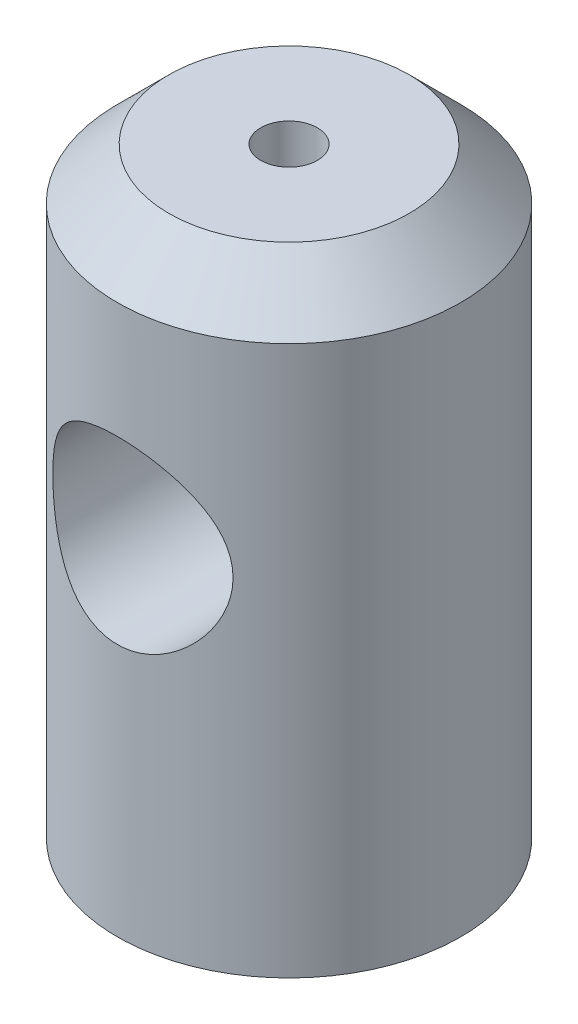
ISO-10303-21;
HEADER;
FILE_DESCRIPTION(('STEP AP214'),'2;1');
FILE_NAME('part.step','',(''),(''),'','','');
FILE_SCHEMA(('AUTOMOTIVE_DESIGN { 1 0 10303 214 1 1 1 1 }'));
ENDSEC;
DATA;
#1=APPLICATION_CONTEXT('core data for automotive mechanical design processes');
#2=APPLICATION_PROTOCOL_DEFINITION('international standard','automotive_design',2000,#1);
#3=PRODUCT_CONTEXT('',#1,'mechanical');
#4=PRODUCT('Part','Part','',(#3));
#5=PRODUCT_RELATED_PRODUCT_CATEGORY('part','',(#4));
#6=PRODUCT_DEFINITION_FORMATION('','',#4);
#7=PRODUCT_DEFINITION_CONTEXT('part definition',#1,'design');
#8=PRODUCT_DEFINITION('design','',#6,#7);
#9=PRODUCT_DEFINITION_SHAPE('','',#8);
#10=(LENGTH_UNIT() NAMED_UNIT(*) SI_UNIT(.MILLI.,.METRE.));
#11=(NAMED_UNIT(*) PLANE_ANGLE_UNIT() SI_UNIT($,.RADIAN.));
#12=(NAMED_UNIT(*) SI_UNIT($,.STERADIAN.) SOLID_ANGLE_UNIT());
#13=UNCERTAINTY_MEASURE_WITH_UNIT(LENGTH_MEASURE(1.E-05),#10,'distance_accuracy_value','');
#14=(GEOMETRIC_REPRESENTATION_CONTEXT(3) GLOBAL_UNCERTAINTY_ASSIGNED_CONTEXT((#13)) GLOBAL_UNIT_ASSIGNED_CONTEXT((#10,
#11,#12)) REPRESENTATION_CONTEXT('',''));
#15=CARTESIAN_POINT('',(0.,0.,0.));
#16=DIRECTION('',(0.,0.,1.));
#17=DIRECTION('',(1.,0.,0.));
#18=AXIS2_PLACEMENT_3D('',#15,#16,#17);
#19=CARTESIAN_POINT('',(0.,35.,0.));
#20=DIRECTION('',(0.,1.,0.));
#21=DIRECTION('',(0.,0.,1.));
#22=AXIS2_PLACEMENT_3D('',#19,#20,#21);
#23=CYLINDRICAL_SURFACE('',#22,1.64999999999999);
#24=CARTESIAN_POINT('',(0.,14.75,1.64999999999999));
#25=CARTESIAN_POINT('',(0.0903138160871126,14.7500003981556,1.64999948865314));
#26=CARTESIAN_POINT('',(0.180633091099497,14.7523524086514,1.64256051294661));
#27=CARTESIAN_POINT('',(0.358628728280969,14.7615045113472,1.61308023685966));
#28=CARTESIAN_POINT('',(0.44630451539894,14.76830556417,1.59103578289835));
#29=CARTESIAN_POINT('',(0.616420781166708,14.7856131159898,1.5331625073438));
#30=CARTESIAN_POINT('',(0.698869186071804,14.7961138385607,1.49735516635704));
#31=CARTESIAN_POINT('',(0.85659145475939,14.819737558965,1.41306442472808));
#32=CARTESIAN_POINT('',(0.931864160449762,14.832860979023,1.36457898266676));
#33=CARTESIAN_POINT('',(1.0754471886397,14.8607960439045,1.25471623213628));
#34=CARTESIAN_POINT('',(1.14350224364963,14.8756447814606,1.19301477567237));
#35=CARTESIAN_POINT('',(1.26848899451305,14.9051430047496,1.05916156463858));
#36=CARTESIAN_POINT('',(1.3254185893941,14.9197924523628,0.987007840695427));
#37=CARTESIAN_POINT('',(1.42792858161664,14.9476322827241,0.83208107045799));
#38=CARTESIAN_POINT('',(1.47318901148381,14.9607769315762,0.749087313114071));
#39=CARTESIAN_POINT('',(1.549003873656,14.9835604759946,0.576186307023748));
#40=CARTESIAN_POINT('',(1.57956223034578,14.9932003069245,0.486280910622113));
#41=CARTESIAN_POINT('',(1.62416947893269,15.0074945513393,0.304991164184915));
#42=CARTESIAN_POINT('',(1.63869230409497,15.0122916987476,0.213734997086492));
#43=CARTESIAN_POINT('',(1.65229695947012,15.0167810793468,0.0299649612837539));
#44=CARTESIAN_POINT('',(1.6513829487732,15.0164746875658,-0.062548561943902));
#45=CARTESIAN_POINT('',(1.63451033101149,15.0109175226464,-0.242276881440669));
#46=CARTESIAN_POINT('',(1.61915550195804,15.0058651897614,-0.32955553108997));
#47=CARTESIAN_POINT('',(1.57481655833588,14.991707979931,-0.500229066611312));
#48=CARTESIAN_POINT('',(1.54583098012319,14.98260266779,-0.583623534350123));
#49=CARTESIAN_POINT('',(1.47462957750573,14.9612142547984,-0.745594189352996));
#50=CARTESIAN_POINT('',(1.43222506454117,14.9488862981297,-0.824081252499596));
#51=CARTESIAN_POINT('',(1.33552053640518,14.9224620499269,-0.973023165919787));
#52=CARTESIAN_POINT('',(1.28121740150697,14.9083652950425,-1.04347590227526));
#53=CARTESIAN_POINT('',(1.15929958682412,14.879196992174,-1.17776098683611));
#54=CARTESIAN_POINT('',(1.09118686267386,14.8641104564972,-1.24113874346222));
#55=CARTESIAN_POINT('',(0.945112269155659,14.8352349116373,-1.3556835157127));
#56=CARTESIAN_POINT('',(0.867149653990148,14.8214460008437,-1.40684960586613));
#57=CARTESIAN_POINT('',(0.70270494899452,14.796571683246,-1.49583139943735));
#58=CARTESIAN_POINT('',(0.616159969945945,14.7855086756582,-1.53353756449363));
#59=CARTESIAN_POINT('',(0.437526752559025,14.7674944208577,-1.59372070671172));
#60=CARTESIAN_POINT('',(0.345440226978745,14.7605419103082,-1.6162023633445));
#61=CARTESIAN_POINT('',(0.162195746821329,14.7517357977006,-1.64452136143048));
#62=CARTESIAN_POINT('',(0.0711417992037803,14.7496937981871,-1.65097401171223));
#63=CARTESIAN_POINT('',(-0.110758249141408,14.7503809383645,-1.64878818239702));
#64=CARTESIAN_POINT('',(-0.201604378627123,14.7531093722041,-1.64015193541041));
#65=CARTESIAN_POINT('',(-0.378129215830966,14.7629069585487,-1.60852687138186));
#66=CARTESIAN_POINT('',(-0.463880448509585,14.7698650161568,-1.58590514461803));
#67=CARTESIAN_POINT('',(-0.630345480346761,14.7873063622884,-1.52740011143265));
#68=CARTESIAN_POINT('',(-0.711058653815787,14.7977900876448,-1.49151516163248));
#69=CARTESIAN_POINT('',(-0.86736096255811,14.8215261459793,-1.40651800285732));
#70=CARTESIAN_POINT('',(-0.942775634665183,14.8348401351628,-1.35710266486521));
#71=CARTESIAN_POINT('',(-1.08444816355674,14.8627153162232,-1.24681048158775));
#72=CARTESIAN_POINT('',(-1.15070350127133,14.8772768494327,-1.18593049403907));
#73=CARTESIAN_POINT('',(-1.27493568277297,14.9067414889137,-1.05154292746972));
#74=CARTESIAN_POINT('',(-1.33247390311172,14.9216348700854,-0.977626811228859));
#75=CARTESIAN_POINT('',(-1.43437044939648,14.9494672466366,-0.820864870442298));
#76=CARTESIAN_POINT('',(-1.47872896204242,14.9624062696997,-0.738019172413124));
#77=CARTESIAN_POINT('',(-1.55273603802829,14.9847225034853,-0.565905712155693));
#78=CARTESIAN_POINT('',(-1.58243963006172,14.9941130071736,-0.476663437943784));
#79=CARTESIAN_POINT('',(-1.62628952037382,15.0081843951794,-0.294087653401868));
#80=CARTESIAN_POINT('',(-1.64044182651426,15.0128670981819,-0.200755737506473));
#81=CARTESIAN_POINT('',(-1.65235277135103,15.0168017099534,-0.0172396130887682));
#82=CARTESIAN_POINT('',(-1.65083165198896,15.0162922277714,0.072893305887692));
#83=CARTESIAN_POINT('',(-1.6331804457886,15.0104803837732,0.251551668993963));
#84=CARTESIAN_POINT('',(-1.61705105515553,15.0051782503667,0.340077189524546));
#85=CARTESIAN_POINT('',(-1.57112569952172,14.9905461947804,0.511703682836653));
#86=CARTESIAN_POINT('',(-1.54153808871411,14.9812778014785,0.594866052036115));
#87=CARTESIAN_POINT('',(-1.46970059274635,14.9597738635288,0.755112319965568));
#88=CARTESIAN_POINT('',(-1.42744811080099,14.9475377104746,0.832194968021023));
#89=CARTESIAN_POINT('',(-1.32952828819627,14.9208738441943,0.981390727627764));
#90=CARTESIAN_POINT('',(-1.27339690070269,14.9063786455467,1.05318718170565));
#91=CARTESIAN_POINT('',(-1.15012648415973,14.8771378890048,1.18657494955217));
#92=CARTESIAN_POINT('',(-1.08298449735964,14.8623922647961,1.24816351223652));
#93=CARTESIAN_POINT('',(-0.936920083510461,14.8337254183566,1.36143308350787));
#94=CARTESIAN_POINT('',(-0.857680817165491,14.8198477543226,1.41271778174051));
#95=CARTESIAN_POINT('',(-0.691270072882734,14.7950306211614,1.50117156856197));
#96=CARTESIAN_POINT('',(-0.604101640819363,14.7840900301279,1.53834604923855));
#97=CARTESIAN_POINT('',(-0.431618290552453,14.7671139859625,1.59491788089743));
#98=CARTESIAN_POINT('',(-0.346727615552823,14.7607523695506,1.61551363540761));
#99=CARTESIAN_POINT('',(-0.17455932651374,14.7521956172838,1.64305352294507));
#100=CARTESIAN_POINT('',(-0.087282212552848,14.7499996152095,1.65000049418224));
#101=CARTESIAN_POINT('',(0.,14.75,1.64999999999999));
#102=B_SPLINE_CURVE_WITH_KNOTS('',3,(#24,#25,#26,#27,#28,#29,#30,#31,#32,#33,#34,#35,#36,#37,
#38,#39,#40,#41,#42,#43,#44,#45,#46,#47,#48,#49,#50,#51,#52,#53,#54,#55,#56,#57,#58,#59,#60,#61,
#62,#63,#64,#65,#66,#67,#68,#69,#70,#71,#72,#73,#74,#75,#76,#77,#78,#79,#80,#81,#82,#83,#84,#85,
#86,#87,#88,#89,#90,#91,#92,#93,#94,#95,#96,#97,#98,#99,#100,#101),.UNSPECIFIED.,.T.,.F.,(4,2,2,
2,2,2,2,2,2,2,2,2,2,2,2,2,2,2,2,2,2,2,2,2,2,2,2,2,2,2,2,2,2,2,2,2,2,2,4),(0.,0.270620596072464,
0.541299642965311,0.811557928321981,1.08185975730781,1.35976161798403,1.63771590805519,
1.92263190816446,2.20747181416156,2.4836470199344,2.75974781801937,3.02479487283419,
3.28987039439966,3.55885253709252,3.82790528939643,4.10935449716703,4.3908250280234,
4.67453660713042,4.958160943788,5.23071678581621,5.50323230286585,5.76888188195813,
6.03456438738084,6.30677004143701,6.57905041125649,6.86225155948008,7.14544869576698,
7.42757418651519,7.70959064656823,7.97870759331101,8.24781171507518,8.51288447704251,
8.77801162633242,9.05361351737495,9.32928956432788,9.61410809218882,9.89881766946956,
10.1604086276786,10.4219451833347),.UNSPECIFIED.);
#103=CARTESIAN_POINT('',(0.,14.75,1.64999999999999));
#104=VERTEX_POINT('',#103);
#105=EDGE_CURVE('E36',#104,#104,#102,.T.);
#106=ORIENTED_EDGE('',*,*,#105,.T.);
#107=EDGE_LOOP('',(#106));
#108=FACE_BOUND('',#107,.T.);
#109=CARTESIAN_POINT('',(0.,0.,0.));
#110=DIRECTION('',(0.,1.,0.));
#111=DIRECTION('',(0.,0.,1.));
#112=AXIS2_PLACEMENT_3D('',#109,#110,#111);
#113=CIRCLE('',#112,1.64999999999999);
#114=CARTESIAN_POINT('',(0.,0.,1.64999999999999));
#115=VERTEX_POINT('',#114);
#116=EDGE_CURVE('E107',#115,#115,#113,.T.);
#117=ORIENTED_EDGE('',*,*,#116,.F.);
#118=EDGE_LOOP('',(#117));
#119=FACE_BOUND('',#118,.T.);
#120=ADVANCED_FACE('F32',(#108,#119),#23,.F.);
#121=CARTESIAN_POINT('',(0.,35.,0.));
#122=DIRECTION('',(0.,1.,0.));
#123=DIRECTION('',(0.,0.,1.));
#124=AXIS2_PLACEMENT_3D('',#121,#122,#123);
#125=PLANE('',#124);
#126=CARTESIAN_POINT('',(0.,35.,0.));
#127=DIRECTION('',(0.,1.,0.));
#128=DIRECTION('',(0.,0.,1.));
#129=AXIS2_PLACEMENT_3D('',#126,#127,#128);
#130=CIRCLE('',#129,1.64999999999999);
#131=CARTESIAN_POINT('',(0.,35.,1.64999999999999));
#132=VERTEX_POINT('',#131);
#133=EDGE_CURVE('E106',#132,#132,#130,.T.);
#134=ORIENTED_EDGE('',*,*,#133,.F.);
#135=EDGE_LOOP('',(#134));
#136=FACE_BOUND('',#135,.T.);
#137=CARTESIAN_POINT('',(0.,35.,0.));
#138=DIRECTION('',(0.,-1.,0.));
#139=DIRECTION('',(0.,0.,-1.));
#140=AXIS2_PLACEMENT_3D('',#137,#138,#139);
#141=CIRCLE('',#140,7.);
#142=CARTESIAN_POINT('',(0.,35.,-7.));
#143=VERTEX_POINT('',#142);
#144=EDGE_CURVE('E10',#143,#143,#141,.T.);
#145=ORIENTED_EDGE('',*,*,#144,.F.);
#146=EDGE_LOOP('',(#145));
#147=FACE_BOUND('',#146,.T.);
#148=ADVANCED_FACE('F34',(#136,#147),#125,.T.);
#149=CARTESIAN_POINT('',(0.,32.,0.));
#150=DIRECTION('',(0.,-1.,0.));
#151=DIRECTION('',(0.,0.,-1.));
#152=AXIS2_PLACEMENT_3D('',#149,#150,#151);
#153=CONICAL_SURFACE('',#152,10.,0.785398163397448);
#154=ORIENTED_EDGE('',*,*,#144,.T.);
#155=EDGE_LOOP('',(#154));
#156=FACE_BOUND('',#155,.T.);
#157=CARTESIAN_POINT('',(0.,32.,0.));
#158=DIRECTION('',(0.,-1.,0.));
#159=DIRECTION('',(0.,0.,-1.));
#160=AXIS2_PLACEMENT_3D('',#157,#158,#159);
#161=CIRCLE('',#160,10.);
#162=CARTESIAN_POINT('',(0.,32.,-10.));
#163=VERTEX_POINT('',#162);
#164=EDGE_CURVE('E44',#163,#163,#161,.T.);
#165=ORIENTED_EDGE('',*,*,#164,.F.);
#166=EDGE_LOOP('',(#165));
#167=FACE_BOUND('',#166,.T.);
#168=ADVANCED_FACE('F81',(#156,#167),#153,.T.);
#169=CARTESIAN_POINT('',(0.,0.,0.));
#170=DIRECTION('',(0.,-1.,0.));
#171=DIRECTION('',(0.,0.,-1.));
#172=AXIS2_PLACEMENT_3D('',#169,#170,#171);
#173=CYLINDRICAL_SURFACE('',#172,10.);
#174=CARTESIAN_POINT('',(0.,25.25,-10.));
#175=CARTESIAN_POINT('',(0.137219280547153,25.2500002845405,-10.0000002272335));
#176=CARTESIAN_POINT('',(0.274435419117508,25.244614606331,-9.9971695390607));
#177=CARTESIAN_POINT('',(0.547846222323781,25.2231383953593,-9.9859196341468));
#178=CARTESIAN_POINT('',(0.684040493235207,25.2070439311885,-9.97749836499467));
#179=CARTESIAN_POINT('',(0.954484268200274,25.1643222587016,-9.95526954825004));
#180=CARTESIAN_POINT('',(1.08873124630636,25.1376824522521,-9.94145555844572));
#181=CARTESIAN_POINT('',(1.35420731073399,25.0741759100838,-9.90878502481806));
#182=CARTESIAN_POINT('',(1.48543513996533,25.037304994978,-9.88992642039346));
#183=CARTESIAN_POINT('',(1.74338589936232,24.9539269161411,-9.84772073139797));
#184=CARTESIAN_POINT('',(1.87012634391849,24.9074635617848,-9.82439408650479));
#185=CARTESIAN_POINT('',(2.11899910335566,24.8052537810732,-9.77374047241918));
#186=CARTESIAN_POINT('',(2.24112965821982,24.7495038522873,-9.74641199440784));
#187=CARTESIAN_POINT('',(2.59949324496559,24.569086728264,-9.65934198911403));
#188=CARTESIAN_POINT('',(2.82796520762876,24.4311649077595,-9.59447028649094));
#189=CARTESIAN_POINT('',(3.27372275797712,24.1139922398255,-9.45204211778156));
#190=CARTESIAN_POINT('',(3.48932750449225,23.9326443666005,-9.37393643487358));
#191=CARTESIAN_POINT('',(3.8886458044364,23.5383334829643,-9.21545596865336));
#192=CARTESIAN_POINT('',(4.07233236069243,23.3253439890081,-9.13507933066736));
#193=CARTESIAN_POINT('',(4.41885642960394,22.8512480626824,-8.97292923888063));
#194=CARTESIAN_POINT('',(4.57845425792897,22.5875602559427,-8.89165111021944));
#195=CARTESIAN_POINT('',(4.7823153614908,22.1716075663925,-8.78267726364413));
#196=CARTESIAN_POINT('',(4.84436102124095,22.0295030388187,-8.74850075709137));
#197=CARTESIAN_POINT('',(4.95595024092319,21.7393030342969,-8.68577293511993));
#198=CARTESIAN_POINT('',(5.00550154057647,21.5912113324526,-8.65721813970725));
#199=CARTESIAN_POINT('',(5.08878465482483,21.2993729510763,-8.60851077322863));
#200=CARTESIAN_POINT('',(5.12330119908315,21.1559180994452,-8.58794984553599));
#201=CARTESIAN_POINT('',(5.18020997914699,20.8658774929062,-8.55374369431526));
#202=CARTESIAN_POINT('',(5.20260898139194,20.7192935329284,-8.54009461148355));
#203=CARTESIAN_POINT('',(5.23492209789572,20.4243606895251,-8.52032581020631));
#204=CARTESIAN_POINT('',(5.24484570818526,20.2760132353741,-8.51420036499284));
#205=CARTESIAN_POINT('',(5.25205946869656,19.9789018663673,-8.50975281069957));
#206=CARTESIAN_POINT('',(5.24935106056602,19.8301380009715,-8.51142981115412));
#207=CARTESIAN_POINT('',(5.23257907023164,19.5537912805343,-8.5217479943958));
#208=CARTESIAN_POINT('',(5.22010486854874,19.426071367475,-8.52941410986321));
#209=CARTESIAN_POINT('',(5.1859224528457,19.1722883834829,-8.55024031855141));
#210=CARTESIAN_POINT('',(5.16421138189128,19.0462258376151,-8.56340211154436));
#211=CARTESIAN_POINT('',(5.11181617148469,18.7966330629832,-8.59478129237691));
#212=CARTESIAN_POINT('',(5.08113266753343,18.6731026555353,-8.61299832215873));
#213=CARTESIAN_POINT('',(5.01112590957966,18.4292574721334,-8.65391561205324));
#214=CARTESIAN_POINT('',(4.97179923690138,18.3089439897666,-8.67661764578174));
#215=CARTESIAN_POINT('',(4.83944266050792,17.9484926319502,-8.75158613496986));
#216=CARTESIAN_POINT('',(4.7331971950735,17.714332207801,-8.80998221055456));
#217=CARTESIAN_POINT('',(4.4892791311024,17.2661129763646,-8.93673383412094));
#218=CARTESIAN_POINT('',(4.35159249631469,17.0520632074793,-9.00509382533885));
#219=CARTESIAN_POINT('',(4.02599923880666,16.6180678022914,-9.15575739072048));
#220=CARTESIAN_POINT('',(3.8337409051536,16.4015852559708,-9.23866411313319));
#221=CARTESIAN_POINT('',(3.41536670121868,16.0023342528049,-9.40135838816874));
#222=CARTESIAN_POINT('',(3.18923148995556,15.8195851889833,-9.48114412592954));
#223=CARTESIAN_POINT('',(2.82128274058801,15.5698133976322,-9.59469562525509));
#224=CARTESIAN_POINT('',(2.68996216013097,15.4888434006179,-9.63242744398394));
#225=CARTESIAN_POINT('',(2.41986332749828,15.3383880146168,-9.70379978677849));
#226=CARTESIAN_POINT('',(2.28108827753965,15.2688977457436,-9.73744204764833));
#227=CARTESIAN_POINT('',(1.99703485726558,15.1421678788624,-9.79964224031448));
#228=CARTESIAN_POINT('',(1.85175947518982,15.0849227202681,-9.82820247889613));
#229=CARTESIAN_POINT('',(1.55574231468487,14.9833638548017,-9.87938315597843));
#230=CARTESIAN_POINT('',(1.40500124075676,14.939048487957,-9.90200435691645));
#231=CARTESIAN_POINT('',(1.11282934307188,14.8672906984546,-9.93888050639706));
#232=CARTESIAN_POINT('',(0.971749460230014,14.8387051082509,-9.95369724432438));
#233=CARTESIAN_POINT('',(0.687234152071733,14.7931815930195,-9.97737832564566));
#234=CARTESIAN_POINT('',(0.543798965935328,14.7762424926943,-9.98624326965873));
#235=CARTESIAN_POINT('',(0.255835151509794,14.7542501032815,-9.9977649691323));
#236=CARTESIAN_POINT('',(0.111307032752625,14.7491915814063,-10.0004244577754));
#237=CARTESIAN_POINT('',(-0.177649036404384,14.7510180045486,-9.99946551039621));
#238=CARTESIAN_POINT('',(-0.322076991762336,14.7579023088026,-9.99584741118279));
#239=CARTESIAN_POINT('',(-0.596977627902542,14.7823894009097,-9.98302883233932));
#240=CARTESIAN_POINT('',(-0.727564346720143,14.7990002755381,-9.97434520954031));
#241=CARTESIAN_POINT('',(-0.986752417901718,14.8418917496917,-9.95204728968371));
#242=CARTESIAN_POINT('',(-1.11535313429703,14.8681753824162,-9.93843144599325));
#243=CARTESIAN_POINT('',(-1.36965004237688,14.9301208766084,-9.90658705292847));
#244=CARTESIAN_POINT('',(-1.49534712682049,14.9657798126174,-9.88835994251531));
#245=CARTESIAN_POINT('',(-1.74314372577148,15.0461184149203,-9.84770291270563));
#246=CARTESIAN_POINT('',(-1.86524183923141,15.0908015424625,-9.82527138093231));
#247=CARTESIAN_POINT('',(-2.23123711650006,15.240316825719,-9.75112230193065));
#248=CARTESIAN_POINT('',(-2.46841439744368,15.3590433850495,-9.69338463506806));
#249=CARTESIAN_POINT('',(-2.92006961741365,15.6290622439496,-9.56704734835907));
#250=CARTESIAN_POINT('',(-3.13453840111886,15.7803676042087,-9.49844337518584));
#251=CARTESIAN_POINT('',(-3.55886678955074,16.1295715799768,-9.34827580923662));
#252=CARTESIAN_POINT('',(-3.76585720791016,16.3307004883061,-9.26610842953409));
#253=CARTESIAN_POINT('',(-4.14465083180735,16.7646733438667,-9.10299232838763));
#254=CARTESIAN_POINT('',(-4.31642352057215,16.9975445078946,-9.02204471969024));
#255=CARTESIAN_POINT('',(-4.54921678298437,17.3749564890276,-8.90577435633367));
#256=CARTESIAN_POINT('',(-4.62443880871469,17.5098103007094,-8.86683357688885));
#257=CARTESIAN_POINT('',(-4.76308083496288,17.7865235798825,-8.7931345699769));
#258=CARTESIAN_POINT('',(-4.82650617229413,17.9283798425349,-8.75837445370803));
#259=CARTESIAN_POINT('',(-4.94081379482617,18.2181203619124,-8.69440356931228));
#260=CARTESIAN_POINT('',(-4.99170730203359,18.3659990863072,-8.66518784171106));
#261=CARTESIAN_POINT('',(-5.08032094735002,18.6668057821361,-8.61353453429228));
#262=CARTESIAN_POINT('',(-5.11804336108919,18.8197328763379,-8.5910957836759));
#263=CARTESIAN_POINT('',(-5.17667803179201,19.114123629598,-8.55587841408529));
#264=CARTESIAN_POINT('',(-5.19887396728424,19.2552448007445,-8.54236940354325));
#265=CARTESIAN_POINT('',(-5.23170136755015,19.5393099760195,-8.52230458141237));
#266=CARTESIAN_POINT('',(-5.24233433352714,19.6822537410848,-8.51574786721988));
#267=CARTESIAN_POINT('',(-5.25185951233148,19.9686108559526,-8.50987680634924));
#268=CARTESIAN_POINT('',(-5.25075745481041,20.1120239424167,-8.510558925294));
#269=CARTESIAN_POINT('',(-5.23684562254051,20.398056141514,-8.51912638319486));
#270=CARTESIAN_POINT('',(-5.22403653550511,20.5406753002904,-8.5270112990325));
#271=CARTESIAN_POINT('',(-5.18905861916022,20.8075526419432,-8.54833517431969));
#272=CARTESIAN_POINT('',(-5.16813575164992,20.9320359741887,-8.5610310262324));
#273=CARTESIAN_POINT('',(-5.11754218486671,21.1786107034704,-8.59136907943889));
#274=CARTESIAN_POINT('',(-5.0878688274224,21.3007013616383,-8.60901278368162));
#275=CARTESIAN_POINT('',(-4.98617367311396,21.6622746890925,-8.66858187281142));
#276=CARTESIAN_POINT('',(-4.90145556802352,21.8972171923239,-8.71715897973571));
#277=CARTESIAN_POINT('',(-4.69456138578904,22.3650285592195,-8.83039079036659));
#278=CARTESIAN_POINT('',(-4.57029454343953,22.5967527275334,-8.89589043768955));
#279=CARTESIAN_POINT('',(-4.28992761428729,23.0376472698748,-9.03443201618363));
#280=CARTESIAN_POINT('',(-4.13381040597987,23.2468054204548,-9.10747799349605));
#281=CARTESIAN_POINT('',(-3.76892931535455,23.6668056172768,-9.26498416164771));
#282=CARTESIAN_POINT('',(-3.55586671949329,23.8738577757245,-9.34962231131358));
#283=CARTESIAN_POINT('',(-3.09590888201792,24.2504194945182,-9.51181668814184));
#284=CARTESIAN_POINT('',(-2.84899294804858,24.4199059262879,-9.58936853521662));
#285=CARTESIAN_POINT('',(-2.45489845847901,24.6432164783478,-9.69497778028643));
#286=CARTESIAN_POINT('',(-2.31807696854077,24.7130413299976,-9.72867771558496));
#287=CARTESIAN_POINT('',(-2.03793218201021,24.8407633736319,-9.79118868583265));
#288=CARTESIAN_POINT('',(-1.89461212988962,24.8986664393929,-9.82000212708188));
#289=CARTESIAN_POINT('',(-1.60279401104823,25.001745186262,-9.8718274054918));
#290=CARTESIAN_POINT('',(-1.45430732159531,25.0469470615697,-9.89485117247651));
#291=CARTESIAN_POINT('',(-1.15317060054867,25.1241423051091,-9.9344468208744));
#292=CARTESIAN_POINT('',(-1.00052299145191,25.1561431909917,-9.95102237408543));
#293=CARTESIAN_POINT('',(-0.70694889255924,25.2041056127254,-9.9759631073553));
#294=CARTESIAN_POINT('',(-0.566275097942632,25.2212954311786,-9.98495530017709));
#295=CARTESIAN_POINT('',(-0.283733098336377,25.2442425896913,-9.99697368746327));
#296=CARTESIAN_POINT('',(-0.141864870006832,25.2499997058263,-9.99999976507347));
#297=CARTESIAN_POINT('',(0.,25.25,-10.));
#298=B_SPLINE_CURVE_WITH_KNOTS('',3,(#174,#175,#176,#177,#178,#179,#180,#181,#182,#183,#184,
#185,#186,#187,#188,#189,#190,#191,#192,#193,#194,#195,#196,#197,#198,#199,#200,#201,#202,#203,
#204,#205,#206,#207,#208,#209,#210,#211,#212,#213,#214,#215,#216,#217,#218,#219,#220,#221,#222,
#223,#224,#225,#226,#227,#228,#229,#230,#231,#232,#233,#234,#235,#236,#237,#238,#239,#240,#241,
#242,#243,#244,#245,#246,#247,#248,#249,#250,#251,#252,#253,#254,#255,#256,#257,#258,#259,#260,
#261,#262,#263,#264,#265,#266,#267,#268,#269,#270,#271,#272,#273,#274,#275,#276,#277,#278,#279,
#280,#281,#282,#283,#284,#285,#286,#287,#288,#289,#290,#291,#292,#293,#294,#295,#296,#297),
.UNSPECIFIED.,.T.,.F.,(4,2,2,2,2,2,2,2,2,2,2,2,2,2,2,2,2,2,2,2,2,2,2,2,2,2,2,2,2,2,2,2,2,2,2,2,
2,2,2,2,2,2,2,2,2,2,2,2,2,2,2,2,2,2,2,2,2,2,2,2,2,4),(0.,0.411518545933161,0.823188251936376,
1.23535125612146,1.6476828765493,2.05817143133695,2.46881515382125,3.28925857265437,
4.16279834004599,5.03707340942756,5.98799664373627,6.4637715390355,6.93925098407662,
7.38552525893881,7.83155007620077,8.2772351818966,8.72286942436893,9.10808235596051,
9.49341451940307,9.87871939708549,10.2641769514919,11.0518764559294,11.8399283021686,
12.7396564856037,13.6399003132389,14.1158328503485,14.591562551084,15.067075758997,
15.542527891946,15.9760601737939,16.4095486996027,16.8428462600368,17.2761205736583,
17.6714347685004,18.0668730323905,18.4621880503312,18.8576549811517,19.6683496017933,
20.4793698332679,21.3758847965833,22.2731733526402,22.750383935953,23.2273781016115,
23.7039435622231,24.1804266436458,24.6102867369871,25.0400910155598,25.4696854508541,
25.8992546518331,26.27941671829,26.6596943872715,27.4197738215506,28.2296595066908,
29.0399817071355,29.9626916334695,30.8859680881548,31.3572036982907,31.8282065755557,
32.298230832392,32.7679870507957,33.1934293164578,33.6188799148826),.UNSPECIFIED.);
#299=CARTESIAN_POINT('',(0.,25.25,-10.));
#300=VERTEX_POINT('',#299);
#301=EDGE_CURVE('E73',#300,#300,#298,.T.);
#302=ORIENTED_EDGE('',*,*,#301,.F.);
#303=EDGE_LOOP('',(#302));
#304=FACE_BOUND('',#303,.T.);
#305=CARTESIAN_POINT('',(5.25,20.,8.5110222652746));
#306=CARTESIAN_POINT('',(5.25000011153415,20.1357514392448,8.51102213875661));
#307=CARTESIAN_POINT('',(5.24472783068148,20.2715017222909,8.51428116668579));
#308=CARTESIAN_POINT('',(5.22371642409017,20.5419322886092,8.52718810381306));
#309=CARTESIAN_POINT('',(5.20797311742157,20.6766121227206,8.53683856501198));
#310=CARTESIAN_POINT('',(5.16620979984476,20.9439830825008,8.56217686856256));
#311=CARTESIAN_POINT('',(5.1401756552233,21.0766712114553,8.5778730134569));
#312=CARTESIAN_POINT('',(5.0781781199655,21.3389542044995,8.61471975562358));
#313=CARTESIAN_POINT('',(5.04221035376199,21.4685476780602,8.63587275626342));
#314=CARTESIAN_POINT('',(4.92050539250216,21.849834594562,8.70617187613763));
#315=CARTESIAN_POINT('',(4.82066987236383,22.09588664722,8.76235005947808));
#316=CARTESIAN_POINT('',(4.58690292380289,22.567542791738,8.88694380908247));
#317=CARTESIAN_POINT('',(4.45296683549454,22.7931440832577,8.95536104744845));
#318=CARTESIAN_POINT('',(4.14045823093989,23.2403965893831,9.10435307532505));
#319=CARTESIAN_POINT('',(3.95892338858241,23.4597988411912,9.18546748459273));
#320=CARTESIAN_POINT('',(3.56235184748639,23.8668933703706,9.34640826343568));
#321=CARTESIAN_POINT('',(3.3472970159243,24.0545683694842,9.42623390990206));
#322=CARTESIAN_POINT('',(2.99390982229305,24.315400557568,9.54219767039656));
#323=CARTESIAN_POINT('',(2.86594292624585,24.4014507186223,9.58150351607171));
#324=CARTESIAN_POINT('',(2.60216421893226,24.5623545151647,9.65647465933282));
#325=CARTESIAN_POINT('',(2.46635559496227,24.6372126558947,9.69214141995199));
#326=CARTESIAN_POINT('',(2.18775739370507,24.7749726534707,9.75880283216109));
#327=CARTESIAN_POINT('',(2.04496991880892,24.8378780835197,9.7897988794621));
#328=CARTESIAN_POINT('',(1.75339203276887,24.9510159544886,9.84619985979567));
#329=CARTESIAN_POINT('',(1.60460233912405,25.0012499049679,9.87160545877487));
#330=CARTESIAN_POINT('',(1.3138930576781,25.0850046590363,9.91431181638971));
#331=CARTESIAN_POINT('',(1.17232789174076,25.1195152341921,9.93208634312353));
#332=CARTESIAN_POINT('',(0.88622288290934,25.176715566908,9.96169079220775));
#333=CARTESIAN_POINT('',(0.741683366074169,25.1994066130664,9.97352136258));
#334=CARTESIAN_POINT('',(0.450916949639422,25.232645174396,9.99088958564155));
#335=CARTESIAN_POINT('',(0.30469100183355,25.2431992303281,9.99643062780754));
#336=CARTESIAN_POINT('',(0.0117709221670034,25.252030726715,10.0010655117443));
#337=CARTESIAN_POINT('',(-0.134923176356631,25.2503090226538,10.000159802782));
#338=CARTESIAN_POINT('',(-0.413419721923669,25.2353724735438,9.99232666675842));
#339=CARTESIAN_POINT('',(-0.545300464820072,25.2232762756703,9.98598537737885));
#340=CARTESIAN_POINT('',(-0.807474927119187,25.1892161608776,9.96821214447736));
#341=CARTESIAN_POINT('',(-0.937768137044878,25.1672491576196,9.95677860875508));
#342=CARTESIAN_POINT('',(-1.1957969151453,25.1136992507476,9.9290932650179));
#343=CARTESIAN_POINT('',(-1.32353332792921,25.0821195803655,9.91284307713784));
#344=CARTESIAN_POINT('',(-1.57570626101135,25.0096795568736,9.8759014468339));
#345=CARTESIAN_POINT('',(-1.70014148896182,24.9688156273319,9.85520829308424));
#346=CARTESIAN_POINT('',(-2.0703370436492,24.8317567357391,9.78657169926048));
#347=CARTESIAN_POINT('',(-2.30999015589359,24.7217229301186,9.73240694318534));
#348=CARTESIAN_POINT('',(-2.76783398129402,24.468799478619,9.61224870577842));
#349=CARTESIAN_POINT('',(-2.98601731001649,24.3258985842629,9.54625117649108));
#350=CARTESIAN_POINT('',(-3.41850347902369,23.9947266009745,9.40058466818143));
#351=CARTESIAN_POINT('',(-3.63017142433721,23.8033249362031,9.3202079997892));
#352=CARTESIAN_POINT('',(-4.01996844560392,23.3887095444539,9.15884392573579));
#353=CARTESIAN_POINT('',(-4.19806715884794,23.1654673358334,9.07785603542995));
#354=CARTESIAN_POINT('',(-4.44301556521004,22.8010249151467,8.95928083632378));
#355=CARTESIAN_POINT('',(-4.52325998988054,22.6695435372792,8.91892188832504));
#356=CARTESIAN_POINT('',(-4.67224831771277,22.399245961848,8.84178268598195));
#357=CARTESIAN_POINT('',(-4.7409974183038,22.260433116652,8.80500081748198));
#358=CARTESIAN_POINT('',(-4.86628280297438,21.9763305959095,8.73638358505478));
#359=CARTESIAN_POINT('',(-4.92282686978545,21.831045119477,8.70454507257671));
#360=CARTESIAN_POINT('',(-5.0230462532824,21.5349031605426,8.64710060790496));
#361=CARTESIAN_POINT('',(-5.06672349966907,21.3840475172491,8.62149372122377));
#362=CARTESIAN_POINT('',(-5.13755824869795,21.0903808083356,8.57945526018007));
#363=CARTESIAN_POINT('',(-5.16576578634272,20.9479053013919,8.56244928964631));
#364=CARTESIAN_POINT('',(-5.21031948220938,20.6604648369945,8.53541182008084));
#365=CARTESIAN_POINT('',(-5.22666738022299,20.5155002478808,8.52537929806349));
#366=CARTESIAN_POINT('',(-5.24722446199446,20.2244927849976,8.51274236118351));
#367=CARTESIAN_POINT('',(-5.25144239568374,20.0784507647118,8.51013259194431));
#368=CARTESIAN_POINT('',(-5.24769026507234,19.7865923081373,8.51244692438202));
#369=CARTESIAN_POINT('',(-5.23972124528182,19.6407758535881,8.51737038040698));
#370=CARTESIAN_POINT('',(-5.21351393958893,19.3691658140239,8.53343254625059));
#371=CARTESIAN_POINT('',(-5.19670740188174,19.243179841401,8.54370310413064));
#372=CARTESIAN_POINT('',(-5.15413105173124,18.9932603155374,8.56945391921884));
#373=CARTESIAN_POINT('',(-5.12835852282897,18.8693273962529,8.58493575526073));
#374=CARTESIAN_POINT('',(-5.03799969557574,18.50180533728,8.63849224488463));
#375=CARTESIAN_POINT('',(-4.96035595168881,18.2623294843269,8.68368853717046));
#376=CARTESIAN_POINT('',(-4.76897945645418,17.7892313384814,8.79029345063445));
#377=CARTESIAN_POINT('',(-4.65377838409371,17.5563588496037,8.85234074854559));
#378=CARTESIAN_POINT('',(-4.39176178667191,17.1118306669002,8.98520961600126));
#379=CARTESIAN_POINT('',(-4.2449300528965,16.9001859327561,9.05603567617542));
#380=CARTESIAN_POINT('',(-3.89961840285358,16.4727736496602,9.21051716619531));
#381=CARTESIAN_POINT('',(-3.6967679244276,16.2606727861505,9.29456824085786));
#382=CARTESIAN_POINT('',(-3.25717023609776,15.8721330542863,9.45757147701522));
#383=CARTESIAN_POINT('',(-3.02040772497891,15.6957103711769,9.53652131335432));
#384=CARTESIAN_POINT('',(-2.63889336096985,15.4588158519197,9.64648954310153));
#385=CARTESIAN_POINT('',(-2.5046126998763,15.3833694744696,9.68230721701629));
#386=CARTESIAN_POINT('',(-2.22905203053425,15.2442019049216,9.74943017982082));
#387=CARTESIAN_POINT('',(-2.08777517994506,15.1804754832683,9.78073747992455));
#388=CARTESIAN_POINT('',(-1.79925761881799,15.0655009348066,9.83790100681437));
#389=CARTESIAN_POINT('',(-1.65202015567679,15.0142461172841,9.86376015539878));
#390=CARTESIAN_POINT('',(-1.3526800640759,14.9248505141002,9.90924610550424));
#391=CARTESIAN_POINT('',(-1.20057808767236,14.8867079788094,9.92887373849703));
#392=CARTESIAN_POINT('',(-0.907841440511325,14.8271460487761,9.9596855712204));
#393=CARTESIAN_POINT('',(-0.767529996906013,14.8044611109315,9.97150524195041));
#394=CARTESIAN_POINT('',(-0.485164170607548,14.7705325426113,9.9892251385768));
#395=CARTESIAN_POINT('',(-0.343109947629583,14.759287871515,9.99512590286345));
#396=CARTESIAN_POINT('',(-0.0584858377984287,14.7483948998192,10.0008417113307));
#397=CARTESIAN_POINT('',(0.0840838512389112,14.7487425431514,10.0006588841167));
#398=CARTESIAN_POINT('',(0.368582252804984,14.7610194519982,9.99421779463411));
#399=CARTESIAN_POINT('',(0.510510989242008,14.7729482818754,9.98795976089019));
#400=CARTESIAN_POINT('',(0.781613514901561,14.8068533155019,9.9702599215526));
#401=CARTESIAN_POINT('',(0.910923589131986,14.8279795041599,9.95925728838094));
#402=CARTESIAN_POINT('',(1.16716936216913,14.8797161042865,9.93248797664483));
#403=CARTESIAN_POINT('',(1.29410429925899,14.9103295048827,9.91671979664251));
#404=CARTESIAN_POINT('',(1.54473082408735,14.9807133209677,9.88078042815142));
#405=CARTESIAN_POINT('',(1.66842334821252,15.0204810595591,9.86061052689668));
#406=CARTESIAN_POINT('',(1.91191950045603,15.108797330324,9.81630856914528));
#407=CARTESIAN_POINT('',(2.03172161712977,15.1573492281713,9.79217499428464));
#408=CARTESIAN_POINT('',(2.39345163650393,15.3196795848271,9.71255382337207));
#409=CARTESIAN_POINT('',(2.62802632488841,15.4474132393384,9.65127915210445));
#410=CARTESIAN_POINT('',(3.07318044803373,15.7352038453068,9.51891233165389));
#411=CARTESIAN_POINT('',(3.28374922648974,15.8952750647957,9.44781585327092));
#412=CARTESIAN_POINT('',(3.69907044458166,16.2631029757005,9.29360167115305));
#413=CARTESIAN_POINT('',(3.90074881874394,16.4741400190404,9.21001428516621));
#414=CARTESIAN_POINT('',(4.26723369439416,16.9278253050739,9.0460548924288));
#415=CARTESIAN_POINT('',(4.43200157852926,17.1705062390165,8.96568632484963));
#416=CARTESIAN_POINT('',(4.65148317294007,17.5607432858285,8.85273637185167));
#417=CARTESIAN_POINT('',(4.72128240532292,17.6986867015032,8.81559811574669));
#418=CARTESIAN_POINT('',(4.84879721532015,17.981177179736,8.74610954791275));
#419=CARTESIAN_POINT('',(4.90651900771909,18.1257207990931,8.71375677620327));
#420=CARTESIAN_POINT('',(5.00905871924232,18.4201051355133,8.65521896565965));
#421=CARTESIAN_POINT('',(5.05390904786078,18.569931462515,8.62901846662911));
#422=CARTESIAN_POINT('',(5.13020862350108,18.8739489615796,8.58387632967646));
#423=CARTESIAN_POINT('',(5.16166687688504,19.0281371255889,8.56492981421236));
#424=CARTESIAN_POINT('',(5.20733979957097,19.3183346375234,8.53722553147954));
#425=CARTESIAN_POINT('',(5.22331551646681,19.4539705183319,8.52743382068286));
#426=CARTESIAN_POINT('',(5.24464584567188,19.7264046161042,8.51433207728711));
#427=CARTESIAN_POINT('',(5.24999988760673,19.8632028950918,8.51102239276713));
#428=CARTESIAN_POINT('',(5.25,20.,8.5110222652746));
#429=B_SPLINE_CURVE_WITH_KNOTS('',3,(#305,#306,#307,#308,#309,#310,#311,#312,#313,#314,#315,
#316,#317,#318,#319,#320,#321,#322,#323,#324,#325,#326,#327,#328,#329,#330,#331,#332,#333,#334,
#335,#336,#337,#338,#339,#340,#341,#342,#343,#344,#345,#346,#347,#348,#349,#350,#351,#352,#353,
#354,#355,#356,#357,#358,#359,#360,#361,#362,#363,#364,#365,#366,#367,#368,#369,#370,#371,#372,
#373,#374,#375,#376,#377,#378,#379,#380,#381,#382,#383,#384,#385,#386,#387,#388,#389,#390,#391,
#392,#393,#394,#395,#396,#397,#398,#399,#400,#401,#402,#403,#404,#405,#406,#407,#408,#409,#410,
#411,#412,#413,#414,#415,#416,#417,#418,#419,#420,#421,#422,#423,#424,#425,#426,#427,#428),
.UNSPECIFIED.,.T.,.F.,(4,2,2,2,2,2,2,2,2,2,2,2,2,2,2,2,2,2,2,2,2,2,2,2,2,2,2,2,2,2,2,2,2,2,2,2,
2,2,2,2,2,2,2,2,2,2,2,2,2,2,2,2,2,2,2,2,2,2,2,2,2,4),(0.,0.407111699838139,0.814386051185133,
1.22222171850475,1.63023731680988,2.44068375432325,3.25124099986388,4.13594165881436,
5.02112257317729,5.49801049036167,5.97470592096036,6.45125862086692,6.92775452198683,
7.36752326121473,7.80724404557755,8.24672774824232,8.68618082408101,9.08346727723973,
9.48087803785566,9.87815527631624,10.2755858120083,11.0795809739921,11.883851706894,
12.7696430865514,13.6562318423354,14.1334127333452,14.6103772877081,15.0870367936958,
15.56362477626,16.0016846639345,16.4396802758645,16.8773598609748,17.3150019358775,
17.6970983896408,18.0793107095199,18.8432475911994,19.6416021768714,20.4403668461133,
21.3523350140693,22.264715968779,22.7385731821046,23.2122184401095,23.685609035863,
24.1589364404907,24.5862351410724,25.0134949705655,25.4406053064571,25.8676995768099,
26.2617049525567,26.6558345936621,27.0498491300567,27.44401495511,28.2624674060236,
29.0812817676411,29.9883655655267,30.8963940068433,31.3728267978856,31.8490138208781,
32.3239911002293,32.7986484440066,33.208874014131,33.6191216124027),.UNSPECIFIED.);
#430=CARTESIAN_POINT('',(5.25,20.,8.5110222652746));
#431=VERTEX_POINT('',#430);
#432=EDGE_CURVE('E68',#431,#431,#429,.T.);
#433=ORIENTED_EDGE('',*,*,#432,.F.);
#434=EDGE_LOOP('',(#433));
#435=FACE_BOUND('',#434,.T.);
#436=ORIENTED_EDGE('',*,*,#164,.T.);
#437=EDGE_LOOP('',(#436));
#438=FACE_BOUND('',#437,.T.);
#439=CARTESIAN_POINT('',(0.,0.,0.));
#440=DIRECTION('',(0.,-1.,0.));
#441=DIRECTION('',(0.,0.,-1.));
#442=AXIS2_PLACEMENT_3D('',#439,#440,#441);
#443=CIRCLE('',#442,10.);
#444=CARTESIAN_POINT('',(0.,0.,-10.));
#445=VERTEX_POINT('',#444);
#446=EDGE_CURVE('E49',#445,#445,#443,.T.);
#447=ORIENTED_EDGE('',*,*,#446,.F.);
#448=EDGE_LOOP('',(#447));
#449=FACE_BOUND('',#448,.T.);
#450=ADVANCED_FACE('F77',(#304,#435,#438,#449),#173,.T.);
#451=CARTESIAN_POINT('',(0.,0.,0.));
#452=DIRECTION('',(0.,-1.,0.));
#453=DIRECTION('',(0.,0.,-1.));
#454=AXIS2_PLACEMENT_3D('',#451,#452,#453);
#455=PLANE('',#454);
#456=ORIENTED_EDGE('',*,*,#116,.T.);
#457=EDGE_LOOP('',(#456));
#458=FACE_BOUND('',#457,.T.);
#459=ORIENTED_EDGE('',*,*,#446,.T.);
#460=EDGE_LOOP('',(#459));
#461=FACE_BOUND('',#460,.T.);
#462=ADVANCED_FACE('F80',(#458,#461),#455,.T.);
#463=CARTESIAN_POINT('',(0.,25.25,1.64999999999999));
#464=CARTESIAN_POINT('',(-0.0903138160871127,25.2499996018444,1.64999948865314));
#465=CARTESIAN_POINT('',(-0.180633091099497,25.2476475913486,1.64256051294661));
#466=CARTESIAN_POINT('',(-0.358628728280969,25.2384954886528,1.61308023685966));
#467=CARTESIAN_POINT('',(-0.44630451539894,25.23169443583,1.59103578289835));
#468=CARTESIAN_POINT('',(-0.616420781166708,25.2143868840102,1.5331625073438));
#469=CARTESIAN_POINT('',(-0.698869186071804,25.2038861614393,1.49735516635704));
#470=CARTESIAN_POINT('',(-0.85659145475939,25.1802624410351,1.41306442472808));
#471=CARTESIAN_POINT('',(-0.931864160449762,25.167139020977,1.36457898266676));
#472=CARTESIAN_POINT('',(-1.0754471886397,25.1392039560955,1.25471623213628));
#473=CARTESIAN_POINT('',(-1.14350224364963,25.1243552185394,1.19301477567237));
#474=CARTESIAN_POINT('',(-1.26848899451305,25.0948569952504,1.05916156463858));
#475=CARTESIAN_POINT('',(-1.3254185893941,25.0802075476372,0.987007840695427));
#476=CARTESIAN_POINT('',(-1.42792858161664,25.0523677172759,0.83208107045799));
#477=CARTESIAN_POINT('',(-1.47318901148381,25.0392230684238,0.749087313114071));
#478=CARTESIAN_POINT('',(-1.549003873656,25.0164395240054,0.576186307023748));
#479=CARTESIAN_POINT('',(-1.57956223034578,25.0067996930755,0.486280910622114));
#480=CARTESIAN_POINT('',(-1.62416947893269,24.9925054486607,0.304991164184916));
#481=CARTESIAN_POINT('',(-1.63869230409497,24.9877083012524,0.213734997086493));
#482=CARTESIAN_POINT('',(-1.65229695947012,24.9832189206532,0.0299649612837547));
#483=CARTESIAN_POINT('',(-1.6513829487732,24.9835253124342,-0.0625485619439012));
#484=CARTESIAN_POINT('',(-1.63451033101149,24.9890824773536,-0.242276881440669));
#485=CARTESIAN_POINT('',(-1.61915550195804,24.9941348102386,-0.329555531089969));
#486=CARTESIAN_POINT('',(-1.57481655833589,25.0082920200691,-0.500229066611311));
#487=CARTESIAN_POINT('',(-1.54583098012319,25.01739733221,-0.583623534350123));
#488=CARTESIAN_POINT('',(-1.47462957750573,25.0387857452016,-0.745594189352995));
#489=CARTESIAN_POINT('',(-1.43222506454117,25.0511137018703,-0.824081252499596));
#490=CARTESIAN_POINT('',(-1.33552053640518,25.0775379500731,-0.973023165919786));
#491=CARTESIAN_POINT('',(-1.28121740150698,25.0916347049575,-1.04347590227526));
#492=CARTESIAN_POINT('',(-1.15929958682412,25.1208030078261,-1.17776098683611));
#493=CARTESIAN_POINT('',(-1.09118686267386,25.1358895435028,-1.24113874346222));
#494=CARTESIAN_POINT('',(-0.94511226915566,25.1647650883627,-1.3556835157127));
#495=CARTESIAN_POINT('',(-0.867149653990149,25.1785539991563,-1.40684960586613));
#496=CARTESIAN_POINT('',(-0.702704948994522,25.2034283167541,-1.49583139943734));
#497=CARTESIAN_POINT('',(-0.616159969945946,25.2144913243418,-1.53353756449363));
#498=CARTESIAN_POINT('',(-0.437526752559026,25.2325055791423,-1.59372070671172));
#499=CARTESIAN_POINT('',(-0.345440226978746,25.2394580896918,-1.6162023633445));
#500=CARTESIAN_POINT('',(-0.16219574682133,25.2482642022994,-1.64452136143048));
#501=CARTESIAN_POINT('',(-0.0711417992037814,25.2503062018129,-1.65097401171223));
#502=CARTESIAN_POINT('',(0.110758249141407,25.2496190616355,-1.64878818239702));
#503=CARTESIAN_POINT('',(0.201604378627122,25.246890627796,-1.64015193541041));
#504=CARTESIAN_POINT('',(0.378129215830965,25.2370930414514,-1.60852687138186));
#505=CARTESIAN_POINT('',(0.463880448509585,25.2301349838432,-1.58590514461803));
#506=CARTESIAN_POINT('',(0.63034548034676,25.2126936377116,-1.52740011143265));
#507=CARTESIAN_POINT('',(0.711058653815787,25.2022099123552,-1.49151516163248));
#508=CARTESIAN_POINT('',(0.86736096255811,25.1784738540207,-1.40651800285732));
#509=CARTESIAN_POINT('',(0.942775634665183,25.1651598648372,-1.35710266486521));
#510=CARTESIAN_POINT('',(1.08444816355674,25.1372846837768,-1.24681048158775));
#511=CARTESIAN_POINT('',(1.15070350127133,25.1227231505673,-1.18593049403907));
#512=CARTESIAN_POINT('',(1.27493568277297,25.0932585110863,-1.05154292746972));
#513=CARTESIAN_POINT('',(1.33247390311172,25.0783651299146,-0.97762681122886));
#514=CARTESIAN_POINT('',(1.43437044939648,25.0505327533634,-0.820864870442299));
#515=CARTESIAN_POINT('',(1.47872896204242,25.0375937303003,-0.738019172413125));
#516=CARTESIAN_POINT('',(1.55273603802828,25.0152774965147,-0.565905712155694));
#517=CARTESIAN_POINT('',(1.58243963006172,25.0058869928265,-0.476663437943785));
#518=CARTESIAN_POINT('',(1.62628952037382,24.9918156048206,-0.29408765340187));
#519=CARTESIAN_POINT('',(1.64044182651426,24.9871329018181,-0.200755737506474));
#520=CARTESIAN_POINT('',(1.65235277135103,24.9831982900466,-0.0172396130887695));
#521=CARTESIAN_POINT('',(1.65083165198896,24.9837077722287,0.0728933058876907));
#522=CARTESIAN_POINT('',(1.6331804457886,24.9895196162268,0.251551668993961));
#523=CARTESIAN_POINT('',(1.61705105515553,24.9948217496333,0.340077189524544));
#524=CARTESIAN_POINT('',(1.57112569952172,25.0094538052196,0.511703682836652));
#525=CARTESIAN_POINT('',(1.54153808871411,25.0187221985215,0.594866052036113));
#526=CARTESIAN_POINT('',(1.46970059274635,25.0402261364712,0.755112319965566));
#527=CARTESIAN_POINT('',(1.42744811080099,25.0524622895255,0.832194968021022));
#528=CARTESIAN_POINT('',(1.32952828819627,25.0791261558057,0.981390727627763));
#529=CARTESIAN_POINT('',(1.27339690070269,25.0936213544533,1.05318718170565));
#530=CARTESIAN_POINT('',(1.15012648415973,25.1228621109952,1.18657494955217));
#531=CARTESIAN_POINT('',(1.08298449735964,25.1376077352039,1.24816351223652));
#532=CARTESIAN_POINT('',(0.936920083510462,25.1662745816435,1.36143308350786));
#533=CARTESIAN_POINT('',(0.857680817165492,25.1801522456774,1.41271778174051));
#534=CARTESIAN_POINT('',(0.691270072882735,25.2049693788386,1.50117156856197));
#535=CARTESIAN_POINT('',(0.604101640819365,25.2159099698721,1.53834604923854));
#536=CARTESIAN_POINT('',(0.431618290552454,25.2328860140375,1.59491788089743));
#537=CARTESIAN_POINT('',(0.346727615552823,25.2392476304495,1.61551363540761));
#538=CARTESIAN_POINT('',(0.17455932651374,25.2478043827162,1.64305352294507));
#539=CARTESIAN_POINT('',(0.0872822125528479,25.2500003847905,1.65000049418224));
#540=CARTESIAN_POINT('',(0.,25.25,1.64999999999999));
#541=B_SPLINE_CURVE_WITH_KNOTS('',3,(#463,#464,#465,#466,#467,#468,#469,#470,#471,#472,#473,
#474,#475,#476,#477,#478,#479,#480,#481,#482,#483,#484,#485,#486,#487,#488,#489,#490,#491,#492,
#493,#494,#495,#496,#497,#498,#499,#500,#501,#502,#503,#504,#505,#506,#507,#508,#509,#510,#511,
#512,#513,#514,#515,#516,#517,#518,#519,#520,#521,#522,#523,#524,#525,#526,#527,#528,#529,#530,
#531,#532,#533,#534,#535,#536,#537,#538,#539,#540),.UNSPECIFIED.,.T.,.F.,(4,2,2,2,2,2,2,2,2,2,2,
2,2,2,2,2,2,2,2,2,2,2,2,2,2,2,2,2,2,2,2,2,2,2,2,2,2,2,4),(0.,0.270620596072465,
0.541299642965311,0.811557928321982,1.08185975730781,1.35976161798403,1.63771590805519,
1.92263190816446,2.20747181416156,2.4836470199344,2.75974781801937,3.02479487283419,
3.28987039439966,3.55885253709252,3.82790528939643,4.10935449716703,4.3908250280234,
4.67453660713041,4.958160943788,5.23071678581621,5.50323230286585,5.76888188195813,
6.03456438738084,6.306770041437,6.57905041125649,6.86225155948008,7.14544869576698,
7.42757418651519,7.70959064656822,7.97870759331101,8.24781171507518,8.51288447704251,
8.77801162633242,9.05361351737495,9.32928956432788,9.61410809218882,9.89881766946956,
10.1604086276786,10.4219451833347),.UNSPECIFIED.);
#542=CARTESIAN_POINT('',(0.,25.25,1.64999999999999));
#543=VERTEX_POINT('',#542);
#544=EDGE_CURVE('E52',#543,#543,#541,.T.);
#545=ORIENTED_EDGE('',*,*,#544,.T.);
#546=EDGE_LOOP('',(#545));
#547=FACE_BOUND('',#546,.T.);
#548=ORIENTED_EDGE('',*,*,#133,.T.);
#549=EDGE_LOOP('',(#548));
#550=FACE_BOUND('',#549,.T.);
#551=ADVANCED_FACE('F56',(#547,#550),#23,.F.);
#552=CARTESIAN_POINT('',(0.,20.,-20.));
#553=DIRECTION('',(0.,0.,1.));
#554=DIRECTION('',(1.,0.,0.));
#555=AXIS2_PLACEMENT_3D('',#552,#553,#554);
#556=CYLINDRICAL_SURFACE('',#555,5.25);
#557=ORIENTED_EDGE('',*,*,#301,.T.);
#558=EDGE_LOOP('',(#557));
#559=FACE_BOUND('',#558,.T.);
#560=ORIENTED_EDGE('',*,*,#432,.T.);
#561=EDGE_LOOP('',(#560));
#562=FACE_BOUND('',#561,.T.);
#563=ORIENTED_EDGE('',*,*,#544,.F.);
#564=EDGE_LOOP('',(#563));
#565=FACE_BOUND('',#564,.T.);
#566=ORIENTED_EDGE('',*,*,#105,.F.);
#567=EDGE_LOOP('',(#566));
#568=FACE_BOUND('',#567,.T.);
#569=ADVANCED_FACE('F59',(#559,#562,#565,#568),#556,.F.);
#570=CLOSED_SHELL('',(#120,#148,#168,#450,#462,#551,#569));
#571=MANIFOLD_SOLID_BREP('B2',#570);
#572=ADVANCED_BREP_SHAPE_REPRESENTATION('',(#18,#571),#14);
#573=SHAPE_DEFINITION_REPRESENTATION(#9,#572);
ENDSEC;
END-ISO-10303-21;
